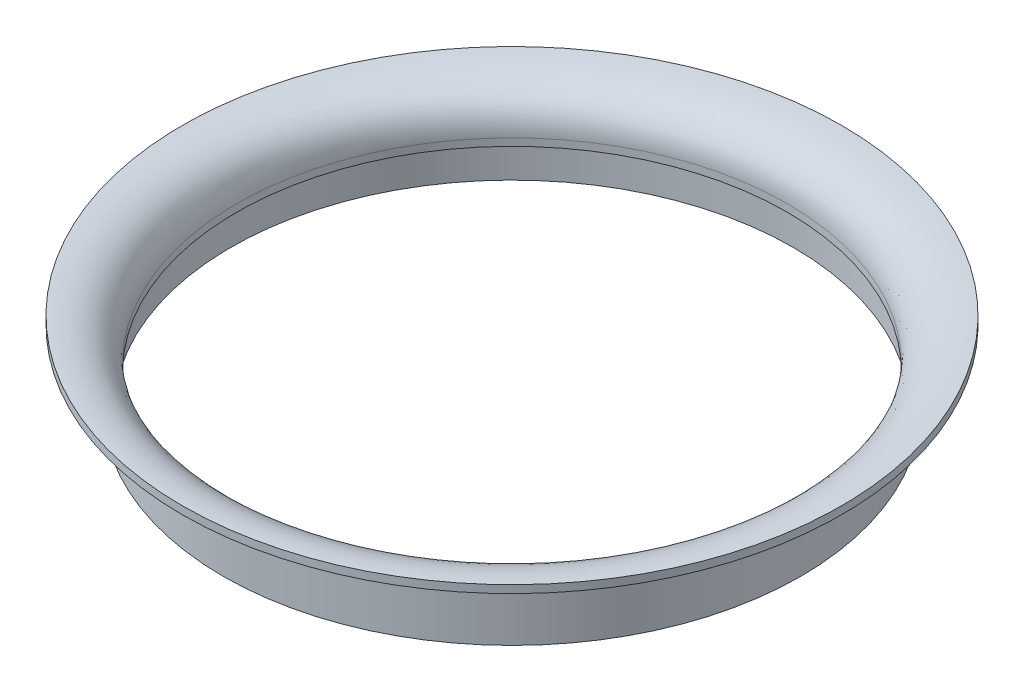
ISO-10303-21;
HEADER;
FILE_DESCRIPTION(('STEP AP214'),'2;1');
FILE_NAME('part.step','',(''),(''),'','','');
FILE_SCHEMA(('AUTOMOTIVE_DESIGN { 1 0 10303 214 1 1 1 1 }'));
ENDSEC;
DATA;
#1=APPLICATION_CONTEXT('core data for automotive mechanical design processes');
#2=APPLICATION_PROTOCOL_DEFINITION('international standard','automotive_design',2000,#1);
#3=PRODUCT_CONTEXT('',#1,'mechanical');
#4=PRODUCT('Part','Part','',(#3));
#5=PRODUCT_RELATED_PRODUCT_CATEGORY('part','',(#4));
#6=PRODUCT_DEFINITION_FORMATION('','',#4);
#7=PRODUCT_DEFINITION_CONTEXT('part definition',#1,'design');
#8=PRODUCT_DEFINITION('design','',#6,#7);
#9=PRODUCT_DEFINITION_SHAPE('','',#8);
#10=(LENGTH_UNIT() NAMED_UNIT(*) SI_UNIT(.MILLI.,.METRE.));
#11=(NAMED_UNIT(*) PLANE_ANGLE_UNIT() SI_UNIT($,.RADIAN.));
#12=(NAMED_UNIT(*) SI_UNIT($,.STERADIAN.) SOLID_ANGLE_UNIT());
#13=UNCERTAINTY_MEASURE_WITH_UNIT(LENGTH_MEASURE(1.E-05),#10,'distance_accuracy_value','');
#14=(GEOMETRIC_REPRESENTATION_CONTEXT(3) GLOBAL_UNCERTAINTY_ASSIGNED_CONTEXT((#13)) GLOBAL_UNIT_ASSIGNED_CONTEXT((#10,
#11,#12)) REPRESENTATION_CONTEXT('',''));
#15=CARTESIAN_POINT('',(0.,0.,0.));
#16=DIRECTION('',(0.,0.,1.));
#17=DIRECTION('',(1.,0.,0.));
#18=AXIS2_PLACEMENT_3D('',#15,#16,#17);
#19=CARTESIAN_POINT('',(35.5,5.24627743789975,0.));
#20=CARTESIAN_POINT('',(35.5,8.14344764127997,0.));
#21=CARTESIAN_POINT('',(37.3081765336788,10.5,0.));
#22=CARTESIAN_POINT('',(42.5,10.5,0.));
#23=B_SPLINE_CURVE_WITH_KNOTS('',3,(#19,#20,#21,#22),.UNSPECIFIED.,.F.,.F.,(4,4),(0.,1.),.UNSPECIFIED.);
#24=CARTESIAN_POINT('',(0.,0.,0.));
#25=DIRECTION('',(0.,-1.,0.));
#26=AXIS1_PLACEMENT('',#24,#25);
#27=SURFACE_OF_REVOLUTION('',#23,#26);
#28=CARTESIAN_POINT('',(0.,10.5,0.));
#29=DIRECTION('',(0.,-1.,0.));
#30=DIRECTION('',(0.,0.,-1.));
#31=AXIS2_PLACEMENT_3D('',#28,#29,#30);
#32=CIRCLE('',#31,42.5);
#33=CARTESIAN_POINT('',(0.,10.5,-42.5));
#34=VERTEX_POINT('',#33);
#35=EDGE_CURVE('E63',#34,#34,#32,.T.);
#36=ORIENTED_EDGE('',*,*,#35,.F.);
#37=EDGE_LOOP('',(#36));
#38=FACE_BOUND('',#37,.T.);
#39=CARTESIAN_POINT('',(0.,5.24627743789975,0.));
#40=DIRECTION('',(0.,-1.,0.));
#41=DIRECTION('',(0.,0.,-1.));
#42=AXIS2_PLACEMENT_3D('',#39,#40,#41);
#43=CIRCLE('',#42,35.5);
#44=CARTESIAN_POINT('',(0.,5.24627743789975,-35.5));
#45=VERTEX_POINT('',#44);
#46=EDGE_CURVE('E10',#45,#45,#43,.T.);
#47=ORIENTED_EDGE('',*,*,#46,.T.);
#48=EDGE_LOOP('',(#47));
#49=FACE_BOUND('',#48,.T.);
#50=ADVANCED_FACE('F34',(#38,#49),#27,.T.);
#51=CARTESIAN_POINT('',(0.,0.,0.));
#52=DIRECTION('',(0.,-1.,0.));
#53=DIRECTION('',(0.,0.,-1.));
#54=AXIS2_PLACEMENT_3D('',#51,#52,#53);
#55=CYLINDRICAL_SURFACE('',#54,35.5);
#56=CARTESIAN_POINT('',(0.,4.3,0.));
#57=DIRECTION('',(0.,-1.,0.));
#58=DIRECTION('',(0.,0.,-1.));
#59=AXIS2_PLACEMENT_3D('',#56,#57,#58);
#60=CIRCLE('',#59,35.5);
#61=CARTESIAN_POINT('',(0.,4.3,-35.5));
#62=VERTEX_POINT('',#61);
#63=EDGE_CURVE('E41',#62,#62,#60,.T.);
#64=ORIENTED_EDGE('',*,*,#63,.T.);
#65=EDGE_LOOP('',(#64));
#66=FACE_BOUND('',#65,.T.);
#67=ORIENTED_EDGE('',*,*,#46,.F.);
#68=EDGE_LOOP('',(#67));
#69=FACE_BOUND('',#68,.T.);
#70=ADVANCED_FACE('F96',(#66,#69),#55,.F.);
#71=CARTESIAN_POINT('',(0.,4.3,0.));
#72=DIRECTION('',(0.,-1.,0.));
#73=DIRECTION('',(0.,0.,-1.));
#74=AXIS2_PLACEMENT_3D('',#71,#72,#73);
#75=PLANE('',#74);
#76=CARTESIAN_POINT('',(0.,4.3,0.));
#77=DIRECTION('',(0.,-1.,0.));
#78=DIRECTION('',(0.,0.,-1.));
#79=AXIS2_PLACEMENT_3D('',#76,#77,#78);
#80=CIRCLE('',#79,36.25);
#81=CARTESIAN_POINT('',(0.,4.3,-36.25));
#82=VERTEX_POINT('',#81);
#83=EDGE_CURVE('E45',#82,#82,#80,.T.);
#84=ORIENTED_EDGE('',*,*,#83,.T.);
#85=EDGE_LOOP('',(#84));
#86=FACE_BOUND('',#85,.T.);
#87=ORIENTED_EDGE('',*,*,#63,.F.);
#88=EDGE_LOOP('',(#87));
#89=FACE_BOUND('',#88,.T.);
#90=ADVANCED_FACE('F93',(#86,#89),#75,.T.);
#91=CARTESIAN_POINT('',(0.,0.,0.));
#92=DIRECTION('',(0.,-1.,0.));
#93=DIRECTION('',(0.,0.,-1.));
#94=AXIS2_PLACEMENT_3D('',#91,#92,#93);
#95=CYLINDRICAL_SURFACE('',#94,36.25);
#96=CARTESIAN_POINT('',(0.,0.,0.));
#97=DIRECTION('',(0.,-1.,0.));
#98=DIRECTION('',(0.,0.,-1.));
#99=AXIS2_PLACEMENT_3D('',#96,#97,#98);
#100=CIRCLE('',#99,36.25);
#101=CARTESIAN_POINT('',(0.,0.,-36.25));
#102=VERTEX_POINT('',#101);
#103=EDGE_CURVE('E49',#102,#102,#100,.T.);
#104=ORIENTED_EDGE('',*,*,#103,.T.);
#105=EDGE_LOOP('',(#104));
#106=FACE_BOUND('',#105,.T.);
#107=ORIENTED_EDGE('',*,*,#83,.F.);
#108=EDGE_LOOP('',(#107));
#109=FACE_BOUND('',#108,.T.);
#110=ADVANCED_FACE('F89',(#106,#109),#95,.F.);
#111=CARTESIAN_POINT('',(0.,0.,0.));
#112=DIRECTION('',(0.,-1.,0.));
#113=DIRECTION('',(0.,0.,-1.));
#114=AXIS2_PLACEMENT_3D('',#111,#112,#113);
#115=PLANE('',#114);
#116=CARTESIAN_POINT('',(0.,0.,0.));
#117=DIRECTION('',(0.,-1.,0.));
#118=DIRECTION('',(0.,0.,-1.));
#119=AXIS2_PLACEMENT_3D('',#116,#117,#118);
#120=CIRCLE('',#119,37.25);
#121=CARTESIAN_POINT('',(0.,0.,-37.25));
#122=VERTEX_POINT('',#121);
#123=EDGE_CURVE('E54',#122,#122,#120,.T.);
#124=ORIENTED_EDGE('',*,*,#123,.T.);
#125=EDGE_LOOP('',(#124));
#126=FACE_BOUND('',#125,.T.);
#127=ORIENTED_EDGE('',*,*,#103,.F.);
#128=EDGE_LOOP('',(#127));
#129=FACE_BOUND('',#128,.T.);
#130=ADVANCED_FACE('F85',(#126,#129),#115,.T.);
#131=CARTESIAN_POINT('',(0.,0.,0.));
#132=DIRECTION('',(0.,-1.,0.));
#133=DIRECTION('',(0.,0.,-1.));
#134=AXIS2_PLACEMENT_3D('',#131,#132,#133);
#135=CYLINDRICAL_SURFACE('',#134,37.25);
#136=CARTESIAN_POINT('',(0.,6.,0.));
#137=DIRECTION('',(0.,-1.,0.));
#138=DIRECTION('',(0.,0.,-1.));
#139=AXIS2_PLACEMENT_3D('',#136,#137,#138);
#140=CIRCLE('',#139,37.25);
#141=CARTESIAN_POINT('',(0.,6.,-37.25));
#142=VERTEX_POINT('',#141);
#143=EDGE_CURVE('E57',#142,#142,#140,.T.);
#144=ORIENTED_EDGE('',*,*,#143,.T.);
#145=EDGE_LOOP('',(#144));
#146=FACE_BOUND('',#145,.T.);
#147=ORIENTED_EDGE('',*,*,#123,.F.);
#148=EDGE_LOOP('',(#147));
#149=FACE_BOUND('',#148,.T.);
#150=ADVANCED_FACE('F81',(#146,#149),#135,.T.);
#151=CARTESIAN_POINT('',(37.25,6.,0.));
#152=CARTESIAN_POINT('',(37.25,8.10323824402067,0.));
#153=CARTESIAN_POINT('',(38.992444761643,9.5,0.));
#154=CARTESIAN_POINT('',(42.5,9.5,0.));
#155=B_SPLINE_CURVE_WITH_KNOTS('',3,(#151,#152,#153,#154),.UNSPECIFIED.,.F.,.F.,(4,4),(0.,1.),.UNSPECIFIED.);
#156=CARTESIAN_POINT('',(0.,0.,0.));
#157=DIRECTION('',(0.,-1.,0.));
#158=AXIS1_PLACEMENT('',#156,#157);
#159=SURFACE_OF_REVOLUTION('',#155,#158);
#160=CARTESIAN_POINT('',(0.,9.5,0.));
#161=DIRECTION('',(0.,-1.,0.));
#162=DIRECTION('',(0.,0.,-1.));
#163=AXIS2_PLACEMENT_3D('',#160,#161,#162);
#164=CIRCLE('',#163,42.5);
#165=CARTESIAN_POINT('',(0.,9.5,-42.5));
#166=VERTEX_POINT('',#165);
#167=EDGE_CURVE('E60',#166,#166,#164,.T.);
#168=ORIENTED_EDGE('',*,*,#167,.T.);
#169=EDGE_LOOP('',(#168));
#170=FACE_BOUND('',#169,.T.);
#171=ORIENTED_EDGE('',*,*,#143,.F.);
#172=EDGE_LOOP('',(#171));
#173=FACE_BOUND('',#172,.T.);
#174=ADVANCED_FACE('F76',(#170,#173),#159,.F.);
#175=CARTESIAN_POINT('',(0.,0.,0.));
#176=DIRECTION('',(0.,-1.,0.));
#177=DIRECTION('',(0.,0.,-1.));
#178=AXIS2_PLACEMENT_3D('',#175,#176,#177);
#179=CYLINDRICAL_SURFACE('',#178,42.5);
#180=ORIENTED_EDGE('',*,*,#35,.T.);
#181=EDGE_LOOP('',(#180));
#182=FACE_BOUND('',#181,.T.);
#183=ORIENTED_EDGE('',*,*,#167,.F.);
#184=EDGE_LOOP('',(#183));
#185=FACE_BOUND('',#184,.T.);
#186=ADVANCED_FACE('F80',(#182,#185),#179,.T.);
#187=CLOSED_SHELL('',(#50,#70,#90,#110,#130,#150,#174,#186));
#188=MANIFOLD_SOLID_BREP('B2',#187);
#189=ADVANCED_BREP_SHAPE_REPRESENTATION('',(#18,#188),#14);
#190=SHAPE_DEFINITION_REPRESENTATION(#9,#189);
ENDSEC;
END-ISO-10303-21;
